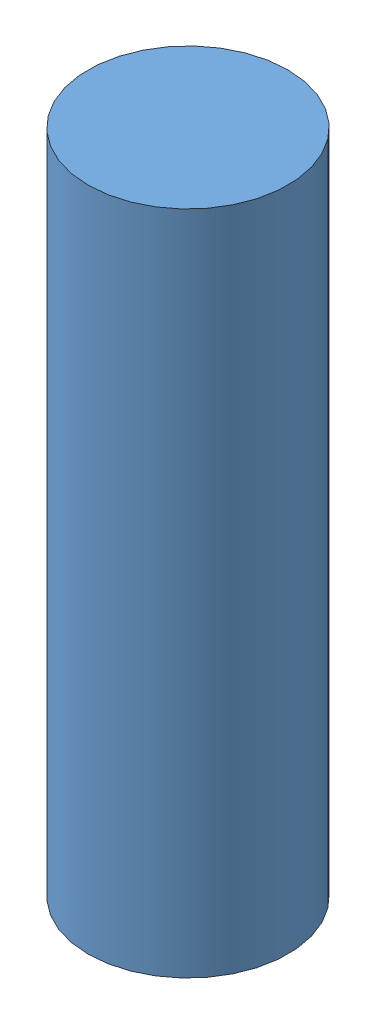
SolidWorks assembly Eddy currents in a conductive disc.SLDASM, configuration Default (file format 10000). Lengths in mm.
Overall size (6 1 6).
6 component instances, 4 part files, 11 mates.
Components (placement in the parent):
- air-1: air.SLDPRT [Default] at origin size (60 200 60) (hidden)
- Disc-1: Disc.SLDPRT [Default] at origin size (6 1 6)
- Cylindrical coil-1: Cylindrical coil.SLDPRT [Default] at origin size (17.5 50 35) (hidden)
- Cylindrical coil-2: Cylindrical coil.SLDPRT [Default] x (-1 0 0) z (0 0 -1) size (17.5 50 35) (hidden)
- Inner Air-1: Inner Air.SLDPRT [Default] at (0 22.5 0) size (30 2.5 30) (hidden)
- Inner Air-2: Inner Air.SLDPRT [Default] at (0 -25 0) size (30 2.5 30) (hidden)
Mates (geometry in assembly coordinates):
- Coincident1: coordinate: unknown of ?
- Coincident2: coordinate: unknown of ?
- Concentric1: concentric anti-aligned: cylinder of air-1 through (0 100 0) axis (0 -1 0) radius 30; cylinder of Cylindrical coil-1 through (0 0 0) axis (0 1 0) radius 15
- Concentric2: concentric anti-aligned: cylinder of air-1 through (0 100 0) axis (0 -1 0) radius 30; cylinder of Cylindrical coil-2 through (0 0 0) axis (0 1 0) radius 15
- Parallel1: parallel anti-aligned: plane of Cylindrical coil-2 through (0 0 0) normal (1 0 0); plane of Cylindrical coil-1 through (0 0 0) normal (-1 0 0)
- Coincident4: coincident aligned: line of Cylindrical coil-1 through (0 25 15) axis (0 0 1); line of Cylindrical coil-2 through (0 25 15) axis (0 0 1)
- Distance1: distance = 75 mm aligned: plane of Cylindrical coil-1 through (0 25 15) normal (0 1 0); plane of air-1 through (0 100 0) normal (0 1 0)
- Concentric3: concentric anti-aligned: cylinder of Cylindrical coil-1 through (0 0 0) axis (0 1 0) radius 15; cylinder of Inner Air-1 through (0 25 0) axis (0 -1 0) radius 15
- Coincident5: coincident aligned: plane of Cylindrical coil-1 through (0 25 15) normal (0 1 0); plane of Inner Air-1 through (0 25 0) normal (0 1 0)
- Concentric4: concentric anti-aligned: cylinder of Cylindrical coil-2 through (0 0 0) axis (0 1 0) radius 15; cylinder of Inner Air-2 through (0 -22.5 0) axis (0 -1 0) radius 15
- Coincident6: coincident aligned: plane of Cylindrical coil-1 through (0 -25 15) normal (0 -1 0); plane of Inner Air-2 through (0 -25 0) normal (0 -1 0)
